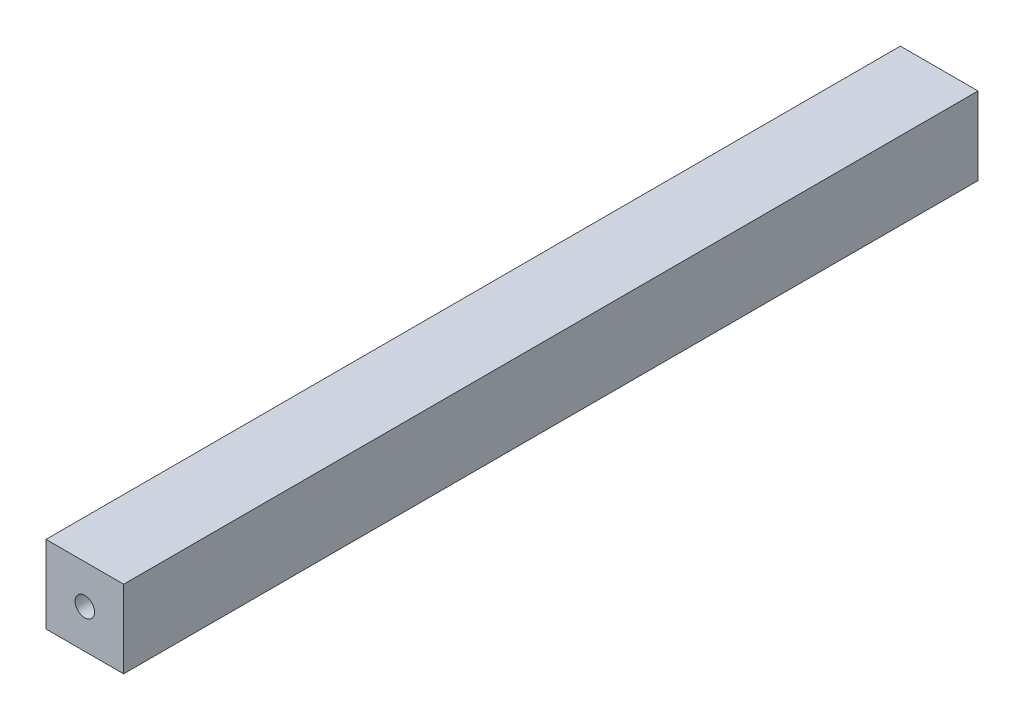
ISO-10303-21;
HEADER;
FILE_DESCRIPTION(('STEP AP214'),'2;1');
FILE_NAME('part.step','',(''),(''),'','','');
FILE_SCHEMA(('AUTOMOTIVE_DESIGN { 1 0 10303 214 1 1 1 1 }'));
ENDSEC;
DATA;
#1=APPLICATION_CONTEXT('core data for automotive mechanical design processes');
#2=APPLICATION_PROTOCOL_DEFINITION('international standard','automotive_design',2000,#1);
#3=PRODUCT_CONTEXT('',#1,'mechanical');
#4=PRODUCT('Part','Part','',(#3));
#5=PRODUCT_RELATED_PRODUCT_CATEGORY('part','',(#4));
#6=PRODUCT_DEFINITION_FORMATION('','',#4);
#7=PRODUCT_DEFINITION_CONTEXT('part definition',#1,'design');
#8=PRODUCT_DEFINITION('design','',#6,#7);
#9=PRODUCT_DEFINITION_SHAPE('','',#8);
#10=(LENGTH_UNIT() NAMED_UNIT(*) SI_UNIT(.MILLI.,.METRE.));
#11=(NAMED_UNIT(*) PLANE_ANGLE_UNIT() SI_UNIT($,.RADIAN.));
#12=(NAMED_UNIT(*) SI_UNIT($,.STERADIAN.) SOLID_ANGLE_UNIT());
#13=UNCERTAINTY_MEASURE_WITH_UNIT(LENGTH_MEASURE(1.E-05),#10,'distance_accuracy_value','');
#14=(GEOMETRIC_REPRESENTATION_CONTEXT(3) GLOBAL_UNCERTAINTY_ASSIGNED_CONTEXT((#13)) GLOBAL_UNIT_ASSIGNED_CONTEXT((#10,
#11,#12)) REPRESENTATION_CONTEXT('',''));
#15=CARTESIAN_POINT('',(0.,0.,0.));
#16=DIRECTION('',(0.,0.,1.));
#17=DIRECTION('',(1.,0.,0.));
#18=AXIS2_PLACEMENT_3D('',#15,#16,#17);
#19=CARTESIAN_POINT('',(-22.3798780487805,-20.,110.));
#20=DIRECTION('',(0.,0.,1.));
#21=DIRECTION('',(1.,0.,0.));
#22=AXIS2_PLACEMENT_3D('',#19,#20,#21);
#23=PLANE('',#22);
#24=DIRECTION('',(0.,-1.,0.));
#25=VECTOR('',#24,1.);
#26=CARTESIAN_POINT('',(-22.3798780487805,-10.,110.));
#27=LINE('',#26,#25);
#28=CARTESIAN_POINT('',(-22.3798780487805,-10.,110.));
#29=VERTEX_POINT('',#28);
#30=CARTESIAN_POINT('',(-22.3798780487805,-20.,110.));
#31=VERTEX_POINT('',#30);
#32=EDGE_CURVE('E104',#29,#31,#27,.T.);
#33=ORIENTED_EDGE('',*,*,#32,.T.);
#34=DIRECTION('',(1.,0.,0.));
#35=VECTOR('',#34,1.);
#36=CARTESIAN_POINT('',(-22.3798780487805,-20.,110.));
#37=LINE('',#36,#35);
#38=CARTESIAN_POINT('',(-12.3798780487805,-20.,110.));
#39=VERTEX_POINT('',#38);
#40=EDGE_CURVE('E89',#31,#39,#37,.T.);
#41=ORIENTED_EDGE('',*,*,#40,.T.);
#42=DIRECTION('',(0.,1.,0.));
#43=VECTOR('',#42,1.);
#44=CARTESIAN_POINT('',(-12.3798780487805,-10.,110.));
#45=LINE('',#44,#43);
#46=CARTESIAN_POINT('',(-12.3798780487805,-10.,110.));
#47=VERTEX_POINT('',#46);
#48=EDGE_CURVE('E55',#39,#47,#45,.T.);
#49=ORIENTED_EDGE('',*,*,#48,.T.);
#50=DIRECTION('',(-1.,0.,0.));
#51=VECTOR('',#50,1.);
#52=CARTESIAN_POINT('',(-22.3798780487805,-10.,110.));
#53=LINE('',#52,#51);
#54=EDGE_CURVE('E50',#47,#29,#53,.T.);
#55=ORIENTED_EDGE('',*,*,#54,.T.);
#56=EDGE_LOOP('',(#33,#41,#49,#55));
#57=FACE_BOUND('',#56,.T.);
#58=CARTESIAN_POINT('',(-17.3798780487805,-15.,110.));
#59=DIRECTION('',(0.,0.,1.));
#60=DIRECTION('',(1.,0.,0.));
#61=AXIS2_PLACEMENT_3D('',#58,#59,#60);
#62=CIRCLE('',#61,1.25);
#63=CARTESIAN_POINT('',(-16.1298780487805,-15.,110.));
#64=VERTEX_POINT('',#63);
#65=EDGE_CURVE('E94',#64,#64,#62,.T.);
#66=ORIENTED_EDGE('',*,*,#65,.F.);
#67=EDGE_LOOP('',(#66));
#68=FACE_BOUND('',#67,.T.);
#69=ADVANCED_FACE('F35',(#57,#68),#23,.T.);
#70=CARTESIAN_POINT('',(-22.3798780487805,-20.,0.));
#71=DIRECTION('',(0.,0.,1.));
#72=DIRECTION('',(1.,0.,0.));
#73=AXIS2_PLACEMENT_3D('',#70,#71,#72);
#74=PLANE('',#73);
#75=DIRECTION('',(0.,-1.,0.));
#76=VECTOR('',#75,1.);
#77=CARTESIAN_POINT('',(-22.3798780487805,-10.,0.));
#78=LINE('',#77,#76);
#79=CARTESIAN_POINT('',(-22.3798780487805,-10.,0.));
#80=VERTEX_POINT('',#79);
#81=CARTESIAN_POINT('',(-22.3798780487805,-20.,0.));
#82=VERTEX_POINT('',#81);
#83=EDGE_CURVE('E81',#80,#82,#78,.T.);
#84=ORIENTED_EDGE('',*,*,#83,.F.);
#85=DIRECTION('',(-1.,0.,0.));
#86=VECTOR('',#85,1.);
#87=CARTESIAN_POINT('',(-22.3798780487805,-10.,0.));
#88=LINE('',#87,#86);
#89=CARTESIAN_POINT('',(-12.3798780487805,-10.,0.));
#90=VERTEX_POINT('',#89);
#91=EDGE_CURVE('E102',#90,#80,#88,.T.);
#92=ORIENTED_EDGE('',*,*,#91,.F.);
#93=DIRECTION('',(0.,1.,0.));
#94=VECTOR('',#93,1.);
#95=CARTESIAN_POINT('',(-12.3798780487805,-10.,0.));
#96=LINE('',#95,#94);
#97=CARTESIAN_POINT('',(-12.3798780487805,-20.,0.));
#98=VERTEX_POINT('',#97);
#99=EDGE_CURVE('E82',#98,#90,#96,.T.);
#100=ORIENTED_EDGE('',*,*,#99,.F.);
#101=DIRECTION('',(1.,0.,0.));
#102=VECTOR('',#101,1.);
#103=CARTESIAN_POINT('',(-22.3798780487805,-20.,0.));
#104=LINE('',#103,#102);
#105=EDGE_CURVE('E76',#82,#98,#104,.T.);
#106=ORIENTED_EDGE('',*,*,#105,.F.);
#107=EDGE_LOOP('',(#84,#92,#100,#106));
#108=FACE_BOUND('',#107,.T.);
#109=CARTESIAN_POINT('',(-17.3798780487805,-15.,0.));
#110=DIRECTION('',(0.,0.,1.));
#111=DIRECTION('',(1.,0.,0.));
#112=AXIS2_PLACEMENT_3D('',#109,#110,#111);
#113=CIRCLE('',#112,1.25);
#114=CARTESIAN_POINT('',(-16.1298780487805,-15.,0.));
#115=VERTEX_POINT('',#114);
#116=EDGE_CURVE('E97',#115,#115,#113,.T.);
#117=ORIENTED_EDGE('',*,*,#116,.T.);
#118=EDGE_LOOP('',(#117));
#119=FACE_BOUND('',#118,.T.);
#120=ADVANCED_FACE('F77',(#108,#119),#74,.F.);
#121=CARTESIAN_POINT('',(-22.3798780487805,-10.,110.));
#122=DIRECTION('',(1.,0.,0.));
#123=DIRECTION('',(0.,0.,-1.));
#124=AXIS2_PLACEMENT_3D('',#121,#122,#123);
#125=PLANE('',#124);
#126=ORIENTED_EDGE('',*,*,#83,.T.);
#127=DIRECTION('',(0.,0.,-1.));
#128=VECTOR('',#127,1.);
#129=CARTESIAN_POINT('',(-22.3798780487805,-20.,110.));
#130=LINE('',#129,#128);
#131=EDGE_CURVE('E11',#31,#82,#130,.T.);
#132=ORIENTED_EDGE('',*,*,#131,.F.);
#133=ORIENTED_EDGE('',*,*,#32,.F.);
#134=DIRECTION('',(0.,0.,-1.));
#135=VECTOR('',#134,1.);
#136=CARTESIAN_POINT('',(-22.3798780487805,-10.,110.));
#137=LINE('',#136,#135);
#138=EDGE_CURVE('E93',#29,#80,#137,.T.);
#139=ORIENTED_EDGE('',*,*,#138,.T.);
#140=EDGE_LOOP('',(#126,#132,#133,#139));
#141=FACE_BOUND('',#140,.T.);
#142=ADVANCED_FACE('F37',(#141),#125,.F.);
#143=CARTESIAN_POINT('',(-22.3798780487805,-20.,110.));
#144=DIRECTION('',(0.,1.,0.));
#145=DIRECTION('',(0.,0.,1.));
#146=AXIS2_PLACEMENT_3D('',#143,#144,#145);
#147=PLANE('',#146);
#148=ORIENTED_EDGE('',*,*,#105,.T.);
#149=DIRECTION('',(0.,0.,-1.));
#150=VECTOR('',#149,1.);
#151=CARTESIAN_POINT('',(-12.3798780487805,-20.,110.));
#152=LINE('',#151,#150);
#153=EDGE_CURVE('E43',#39,#98,#152,.T.);
#154=ORIENTED_EDGE('',*,*,#153,.F.);
#155=ORIENTED_EDGE('',*,*,#40,.F.);
#156=ORIENTED_EDGE('',*,*,#131,.T.);
#157=EDGE_LOOP('',(#148,#154,#155,#156));
#158=FACE_BOUND('',#157,.T.);
#159=ADVANCED_FACE('F88',(#158),#147,.F.);
#160=CARTESIAN_POINT('',(-12.3798780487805,-10.,110.));
#161=DIRECTION('',(-1.,0.,0.));
#162=DIRECTION('',(0.,-1.,0.));
#163=AXIS2_PLACEMENT_3D('',#160,#161,#162);
#164=PLANE('',#163);
#165=ORIENTED_EDGE('',*,*,#99,.T.);
#166=DIRECTION('',(0.,0.,-1.));
#167=VECTOR('',#166,1.);
#168=CARTESIAN_POINT('',(-12.3798780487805,-10.,110.));
#169=LINE('',#168,#167);
#170=EDGE_CURVE('E110',#47,#90,#169,.T.);
#171=ORIENTED_EDGE('',*,*,#170,.F.);
#172=ORIENTED_EDGE('',*,*,#48,.F.);
#173=ORIENTED_EDGE('',*,*,#153,.T.);
#174=EDGE_LOOP('',(#165,#171,#172,#173));
#175=FACE_BOUND('',#174,.T.);
#176=ADVANCED_FACE('F113',(#175),#164,.F.);
#177=CARTESIAN_POINT('',(-22.3798780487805,-10.,110.));
#178=DIRECTION('',(0.,-1.,0.));
#179=DIRECTION('',(0.,0.,-1.));
#180=AXIS2_PLACEMENT_3D('',#177,#178,#179);
#181=PLANE('',#180);
#182=ORIENTED_EDGE('',*,*,#91,.T.);
#183=ORIENTED_EDGE('',*,*,#138,.F.);
#184=ORIENTED_EDGE('',*,*,#54,.F.);
#185=ORIENTED_EDGE('',*,*,#170,.T.);
#186=EDGE_LOOP('',(#182,#183,#184,#185));
#187=FACE_BOUND('',#186,.T.);
#188=ADVANCED_FACE('F115',(#187),#181,.F.);
#189=CARTESIAN_POINT('',(-17.3798780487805,-15.,110.));
#190=DIRECTION('',(0.,0.,-1.));
#191=DIRECTION('',(-1.,0.,0.));
#192=AXIS2_PLACEMENT_3D('',#189,#190,#191);
#193=CYLINDRICAL_SURFACE('',#192,1.25);
#194=ORIENTED_EDGE('',*,*,#65,.T.);
#195=EDGE_LOOP('',(#194));
#196=FACE_BOUND('',#195,.T.);
#197=ORIENTED_EDGE('',*,*,#116,.F.);
#198=EDGE_LOOP('',(#197));
#199=FACE_BOUND('',#198,.T.);
#200=ADVANCED_FACE('F121',(#196,#199),#193,.F.);
#201=CLOSED_SHELL('',(#69,#120,#142,#159,#176,#188,#200));
#202=MANIFOLD_SOLID_BREP('B2',#201);
#203=ADVANCED_BREP_SHAPE_REPRESENTATION('',(#18,#202),#14);
#204=SHAPE_DEFINITION_REPRESENTATION(#9,#203);
ENDSEC;
END-ISO-10303-21;
